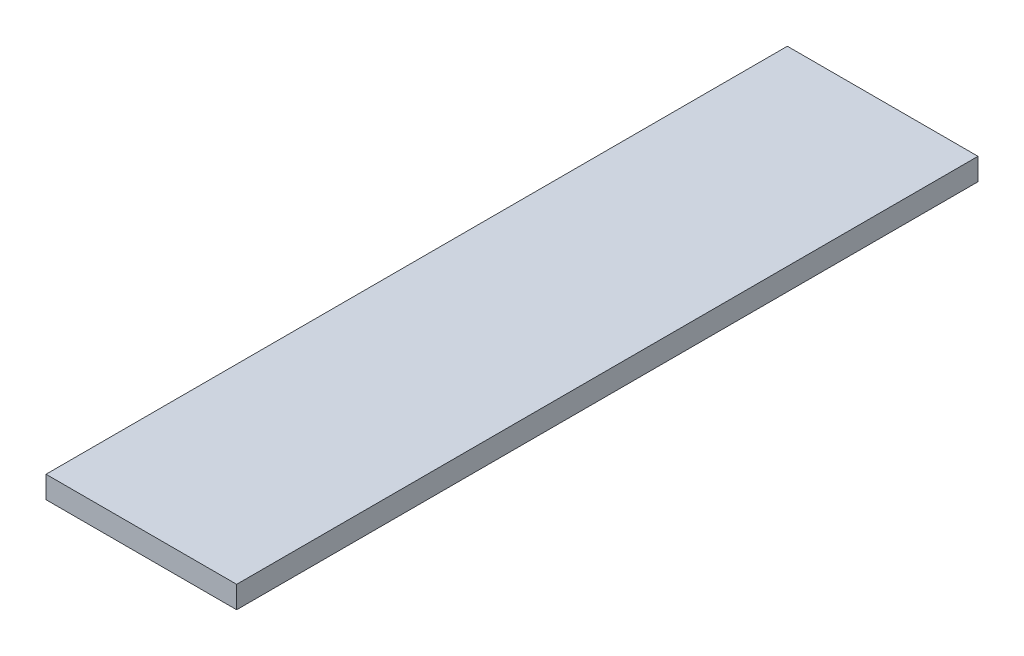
ISO-10303-21;
HEADER;
FILE_DESCRIPTION(('STEP AP214'),'2;1');
FILE_NAME('part.step','',(''),(''),'','','');
FILE_SCHEMA(('AUTOMOTIVE_DESIGN { 1 0 10303 214 1 1 1 1 }'));
ENDSEC;
DATA;
#1=APPLICATION_CONTEXT('core data for automotive mechanical design processes');
#2=APPLICATION_PROTOCOL_DEFINITION('international standard','automotive_design',2000,#1);
#3=PRODUCT_CONTEXT('',#1,'mechanical');
#4=PRODUCT('Part','Part','',(#3));
#5=PRODUCT_RELATED_PRODUCT_CATEGORY('part','',(#4));
#6=PRODUCT_DEFINITION_FORMATION('','',#4);
#7=PRODUCT_DEFINITION_CONTEXT('part definition',#1,'design');
#8=PRODUCT_DEFINITION('design','',#6,#7);
#9=PRODUCT_DEFINITION_SHAPE('','',#8);
#10=(LENGTH_UNIT() NAMED_UNIT(*) SI_UNIT(.MILLI.,.METRE.));
#11=(NAMED_UNIT(*) PLANE_ANGLE_UNIT() SI_UNIT($,.RADIAN.));
#12=(NAMED_UNIT(*) SI_UNIT($,.STERADIAN.) SOLID_ANGLE_UNIT());
#13=UNCERTAINTY_MEASURE_WITH_UNIT(LENGTH_MEASURE(1.E-05),#10,'distance_accuracy_value','');
#14=(GEOMETRIC_REPRESENTATION_CONTEXT(3) GLOBAL_UNCERTAINTY_ASSIGNED_CONTEXT((#13)) GLOBAL_UNIT_ASSIGNED_CONTEXT((#10,
#11,#12)) REPRESENTATION_CONTEXT('',''));
#15=CARTESIAN_POINT('',(0.,0.,0.));
#16=DIRECTION('',(0.,0.,1.));
#17=DIRECTION('',(1.,0.,0.));
#18=AXIS2_PLACEMENT_3D('',#15,#16,#17);
#19=CARTESIAN_POINT('',(-30.861,-3.571875,120.000000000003));
#20=DIRECTION('',(1.,0.,0.));
#21=DIRECTION('',(0.,0.,-1.));
#22=AXIS2_PLACEMENT_3D('',#19,#20,#21);
#23=PLANE('',#22);
#24=DIRECTION('',(0.,-1.,0.));
#25=VECTOR('',#24,1.);
#26=CARTESIAN_POINT('',(-30.861,-3.571875,-120.000000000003));
#27=LINE('',#26,#25);
#28=CARTESIAN_POINT('',(-30.861,3.571875,-120.000000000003));
#29=VERTEX_POINT('',#28);
#30=CARTESIAN_POINT('',(-30.861,-3.571875,-120.000000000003));
#31=VERTEX_POINT('',#30);
#32=EDGE_CURVE('E111',#29,#31,#27,.T.);
#33=ORIENTED_EDGE('',*,*,#32,.T.);
#34=DIRECTION('',(0.,0.,-1.));
#35=VECTOR('',#34,1.);
#36=CARTESIAN_POINT('',(-30.861,-3.571875,120.000000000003));
#37=LINE('',#36,#35);
#38=CARTESIAN_POINT('',(-30.861,-3.571875,120.000000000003));
#39=VERTEX_POINT('',#38);
#40=EDGE_CURVE('E11',#39,#31,#37,.T.);
#41=ORIENTED_EDGE('',*,*,#40,.F.);
#42=DIRECTION('',(0.,-1.,0.));
#43=VECTOR('',#42,1.);
#44=CARTESIAN_POINT('',(-30.861,-3.571875,120.000000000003));
#45=LINE('',#44,#43);
#46=CARTESIAN_POINT('',(-30.861,3.571875,120.000000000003));
#47=VERTEX_POINT('',#46);
#48=EDGE_CURVE('E95',#47,#39,#45,.T.);
#49=ORIENTED_EDGE('',*,*,#48,.F.);
#50=DIRECTION('',(0.,0.,-1.));
#51=VECTOR('',#50,1.);
#52=CARTESIAN_POINT('',(-30.861,3.571875,120.000000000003));
#53=LINE('',#52,#51);
#54=EDGE_CURVE('E107',#47,#29,#53,.T.);
#55=ORIENTED_EDGE('',*,*,#54,.T.);
#56=EDGE_LOOP('',(#33,#41,#49,#55));
#57=FACE_BOUND('',#56,.T.);
#58=ADVANCED_FACE('F43',(#57),#23,.F.);
#59=CARTESIAN_POINT('',(30.861,-3.571875,120.000000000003));
#60=DIRECTION('',(0.,1.,0.));
#61=DIRECTION('',(0.,0.,1.));
#62=AXIS2_PLACEMENT_3D('',#59,#60,#61);
#63=PLANE('',#62);
#64=DIRECTION('',(1.,0.,0.));
#65=VECTOR('',#64,1.);
#66=CARTESIAN_POINT('',(30.861,-3.571875,-120.000000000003));
#67=LINE('',#66,#65);
#68=CARTESIAN_POINT('',(30.861,-3.571875,-120.000000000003));
#69=VERTEX_POINT('',#68);
#70=EDGE_CURVE('E100',#31,#69,#67,.T.);
#71=ORIENTED_EDGE('',*,*,#70,.T.);
#72=DIRECTION('',(0.,0.,-1.));
#73=VECTOR('',#72,1.);
#74=CARTESIAN_POINT('',(30.861,-3.571875,120.000000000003));
#75=LINE('',#74,#73);
#76=CARTESIAN_POINT('',(30.861,-3.571875,120.000000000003));
#77=VERTEX_POINT('',#76);
#78=EDGE_CURVE('E52',#77,#69,#75,.T.);
#79=ORIENTED_EDGE('',*,*,#78,.F.);
#80=DIRECTION('',(1.,0.,0.));
#81=VECTOR('',#80,1.);
#82=CARTESIAN_POINT('',(30.861,-3.571875,120.000000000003));
#83=LINE('',#82,#81);
#84=EDGE_CURVE('E90',#39,#77,#83,.T.);
#85=ORIENTED_EDGE('',*,*,#84,.F.);
#86=ORIENTED_EDGE('',*,*,#40,.T.);
#87=EDGE_LOOP('',(#71,#79,#85,#86));
#88=FACE_BOUND('',#87,.T.);
#89=ADVANCED_FACE('F99',(#88),#63,.F.);
#90=CARTESIAN_POINT('',(30.861,3.571875,120.000000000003));
#91=DIRECTION('',(-1.,0.,0.));
#92=DIRECTION('',(0.,0.,1.));
#93=AXIS2_PLACEMENT_3D('',#90,#91,#92);
#94=PLANE('',#93);
#95=DIRECTION('',(0.,1.,0.));
#96=VECTOR('',#95,1.);
#97=CARTESIAN_POINT('',(30.861,3.571875,-120.000000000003));
#98=LINE('',#97,#96);
#99=CARTESIAN_POINT('',(30.861,3.571875,-120.000000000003));
#100=VERTEX_POINT('',#99);
#101=EDGE_CURVE('E77',#69,#100,#98,.T.);
#102=ORIENTED_EDGE('',*,*,#101,.T.);
#103=DIRECTION('',(0.,0.,-1.));
#104=VECTOR('',#103,1.);
#105=CARTESIAN_POINT('',(30.861,3.571875,120.000000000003));
#106=LINE('',#105,#104);
#107=CARTESIAN_POINT('',(30.861,3.571875,120.000000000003));
#108=VERTEX_POINT('',#107);
#109=EDGE_CURVE('E102',#108,#100,#106,.T.);
#110=ORIENTED_EDGE('',*,*,#109,.F.);
#111=DIRECTION('',(0.,1.,0.));
#112=VECTOR('',#111,1.);
#113=CARTESIAN_POINT('',(30.861,3.571875,120.000000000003));
#114=LINE('',#113,#112);
#115=EDGE_CURVE('E93',#77,#108,#114,.T.);
#116=ORIENTED_EDGE('',*,*,#115,.F.);
#117=ORIENTED_EDGE('',*,*,#78,.T.);
#118=EDGE_LOOP('',(#102,#110,#116,#117));
#119=FACE_BOUND('',#118,.T.);
#120=ADVANCED_FACE('F103',(#119),#94,.F.);
#121=CARTESIAN_POINT('',(-30.861,3.571875,120.000000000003));
#122=DIRECTION('',(0.,-1.,0.));
#123=DIRECTION('',(0.,0.,-1.));
#124=AXIS2_PLACEMENT_3D('',#121,#122,#123);
#125=PLANE('',#124);
#126=DIRECTION('',(-1.,0.,0.));
#127=VECTOR('',#126,1.);
#128=CARTESIAN_POINT('',(-30.861,3.571875,-120.000000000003));
#129=LINE('',#128,#127);
#130=EDGE_CURVE('E83',#100,#29,#129,.T.);
#131=ORIENTED_EDGE('',*,*,#130,.T.);
#132=ORIENTED_EDGE('',*,*,#54,.F.);
#133=DIRECTION('',(-1.,0.,0.));
#134=VECTOR('',#133,1.);
#135=CARTESIAN_POINT('',(-30.861,3.571875,120.000000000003));
#136=LINE('',#135,#134);
#137=EDGE_CURVE('E60',#108,#47,#136,.T.);
#138=ORIENTED_EDGE('',*,*,#137,.F.);
#139=ORIENTED_EDGE('',*,*,#109,.T.);
#140=EDGE_LOOP('',(#131,#132,#138,#139));
#141=FACE_BOUND('',#140,.T.);
#142=ADVANCED_FACE('F124',(#141),#125,.F.);
#143=CARTESIAN_POINT('',(0.,0.,120.000000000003));
#144=DIRECTION('',(0.,0.,-1.));
#145=DIRECTION('',(-1.,0.,0.));
#146=AXIS2_PLACEMENT_3D('',#143,#144,#145);
#147=PLANE('',#146);
#148=ORIENTED_EDGE('',*,*,#48,.T.);
#149=ORIENTED_EDGE('',*,*,#84,.T.);
#150=ORIENTED_EDGE('',*,*,#115,.T.);
#151=ORIENTED_EDGE('',*,*,#137,.T.);
#152=EDGE_LOOP('',(#148,#149,#150,#151));
#153=FACE_BOUND('',#152,.T.);
#154=ADVANCED_FACE('F91',(#153),#147,.F.);
#155=CARTESIAN_POINT('',(0.,0.,-120.000000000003));
#156=DIRECTION('',(0.,0.,-1.));
#157=DIRECTION('',(-1.,0.,0.));
#158=AXIS2_PLACEMENT_3D('',#155,#156,#157);
#159=PLANE('',#158);
#160=ORIENTED_EDGE('',*,*,#32,.F.);
#161=ORIENTED_EDGE('',*,*,#130,.F.);
#162=ORIENTED_EDGE('',*,*,#101,.F.);
#163=ORIENTED_EDGE('',*,*,#70,.F.);
#164=EDGE_LOOP('',(#160,#161,#162,#163));
#165=FACE_BOUND('',#164,.T.);
#166=ADVANCED_FACE('F127',(#165),#159,.T.);
#167=CLOSED_SHELL('',(#58,#89,#120,#142,#154,#166));
#168=MANIFOLD_SOLID_BREP('B2',#167);
#169=ADVANCED_BREP_SHAPE_REPRESENTATION('',(#18,#168),#14);
#170=SHAPE_DEFINITION_REPRESENTATION(#9,#169);
ENDSEC;
END-ISO-10303-21;
